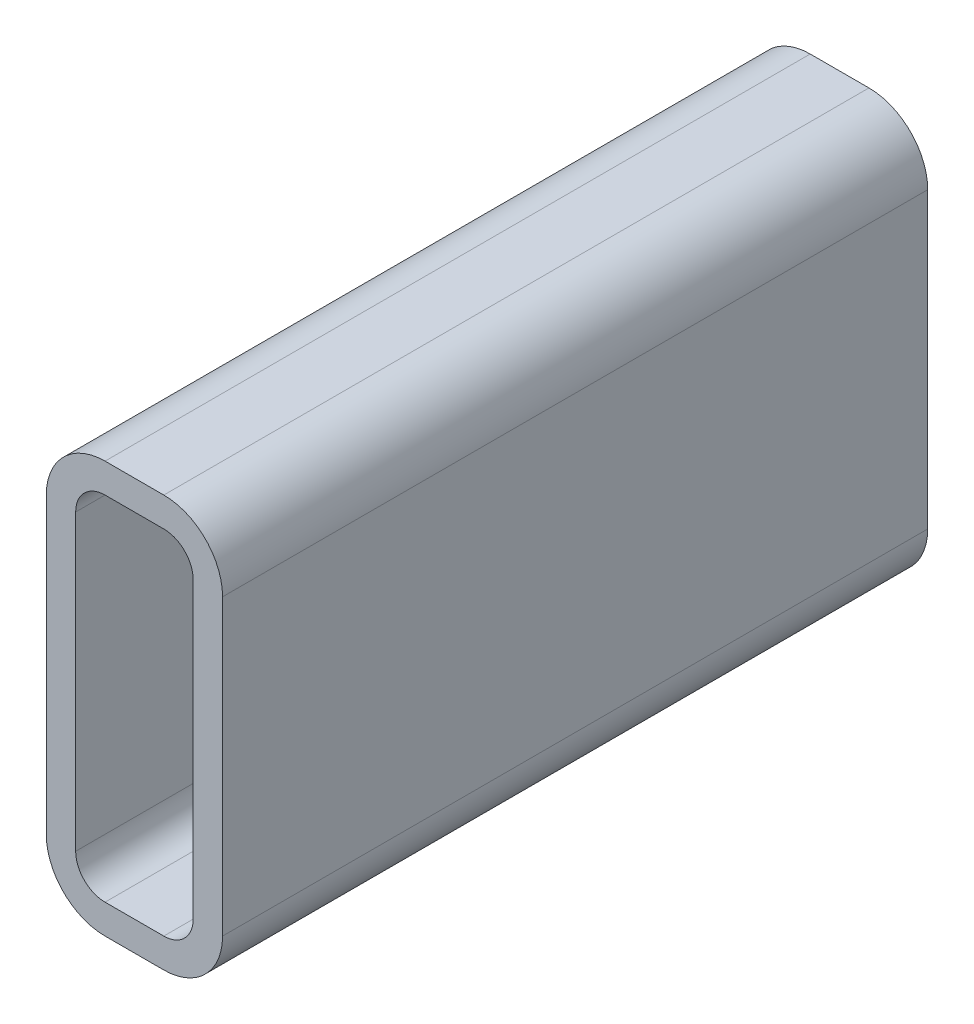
ISO-10303-21;
HEADER;
FILE_DESCRIPTION(('STEP AP214'),'2;1');
FILE_NAME('part.step','',(''),(''),'','','');
FILE_SCHEMA(('AUTOMOTIVE_DESIGN { 1 0 10303 214 1 1 1 1 }'));
ENDSEC;
DATA;
#1=APPLICATION_CONTEXT('core data for automotive mechanical design processes');
#2=APPLICATION_PROTOCOL_DEFINITION('international standard','automotive_design',2000,#1);
#3=PRODUCT_CONTEXT('',#1,'mechanical');
#4=PRODUCT('Part','Part','',(#3));
#5=PRODUCT_RELATED_PRODUCT_CATEGORY('part','',(#4));
#6=PRODUCT_DEFINITION_FORMATION('','',#4);
#7=PRODUCT_DEFINITION_CONTEXT('part definition',#1,'design');
#8=PRODUCT_DEFINITION('design','',#6,#7);
#9=PRODUCT_DEFINITION_SHAPE('','',#8);
#10=(LENGTH_UNIT() NAMED_UNIT(*) SI_UNIT(.MILLI.,.METRE.));
#11=(NAMED_UNIT(*) PLANE_ANGLE_UNIT() SI_UNIT($,.RADIAN.));
#12=(NAMED_UNIT(*) SI_UNIT($,.STERADIAN.) SOLID_ANGLE_UNIT());
#13=UNCERTAINTY_MEASURE_WITH_UNIT(LENGTH_MEASURE(1.E-05),#10,'distance_accuracy_value','');
#14=(GEOMETRIC_REPRESENTATION_CONTEXT(3) GLOBAL_UNCERTAINTY_ASSIGNED_CONTEXT((#13)) GLOBAL_UNIT_ASSIGNED_CONTEXT((#10,
#11,#12)) REPRESENTATION_CONTEXT('',''));
#15=CARTESIAN_POINT('',(0.,0.,0.));
#16=DIRECTION('',(0.,0.,1.));
#17=DIRECTION('',(1.,0.,0.));
#18=AXIS2_PLACEMENT_3D('',#15,#16,#17);
#19=CARTESIAN_POINT('',(27.8891160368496,154.389039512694,304.8));
#20=DIRECTION('',(0.,0.,1.));
#21=DIRECTION('',(1.,0.,0.));
#22=AXIS2_PLACEMENT_3D('',#19,#20,#21);
#23=PLANE('',#22);
#24=CARTESIAN_POINT('',(27.8891160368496,154.389039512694,304.8));
#25=DIRECTION('',(0.,0.,1.));
#26=DIRECTION('',(1.,0.,0.));
#27=AXIS2_PLACEMENT_3D('',#24,#25,#26);
#28=CIRCLE('',#27,25.4);
#29=CARTESIAN_POINT('',(27.8891160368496,179.789039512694,304.8));
#30=VERTEX_POINT('',#29);
#31=CARTESIAN_POINT('',(2.48911603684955,154.389039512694,304.8));
#32=VERTEX_POINT('',#31);
#33=EDGE_CURVE('E211',#30,#32,#28,.T.);
#34=ORIENTED_EDGE('',*,*,#33,.T.);
#35=DIRECTION('',(0.,-1.,0.));
#36=VECTOR('',#35,1.);
#37=CARTESIAN_POINT('',(2.48911603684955,27.3890395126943,304.8));
#38=LINE('',#37,#36);
#39=CARTESIAN_POINT('',(2.48911603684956,27.3890395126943,304.8));
#40=VERTEX_POINT('',#39);
#41=EDGE_CURVE('E214',#32,#40,#38,.T.);
#42=ORIENTED_EDGE('',*,*,#41,.T.);
#43=CARTESIAN_POINT('',(27.8891160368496,27.3890395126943,304.8));
#44=DIRECTION('',(0.,0.,1.));
#45=DIRECTION('',(1.,0.,0.));
#46=AXIS2_PLACEMENT_3D('',#43,#44,#45);
#47=CIRCLE('',#46,25.4);
#48=CARTESIAN_POINT('',(27.8891160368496,1.98903951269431,304.8));
#49=VERTEX_POINT('',#48);
#50=EDGE_CURVE('E217',#40,#49,#47,.T.);
#51=ORIENTED_EDGE('',*,*,#50,.T.);
#52=DIRECTION('',(1.,0.,0.));
#53=VECTOR('',#52,1.);
#54=CARTESIAN_POINT('',(53.2891160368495,1.98903951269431,304.8));
#55=LINE('',#54,#53);
#56=CARTESIAN_POINT('',(53.2891160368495,1.98903951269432,304.8));
#57=VERTEX_POINT('',#56);
#58=EDGE_CURVE('E219',#49,#57,#55,.T.);
#59=ORIENTED_EDGE('',*,*,#58,.T.);
#60=CARTESIAN_POINT('',(53.2891160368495,27.3890395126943,304.8));
#61=DIRECTION('',(0.,0.,1.));
#62=DIRECTION('',(1.,0.,0.));
#63=AXIS2_PLACEMENT_3D('',#60,#61,#62);
#64=CIRCLE('',#63,25.4);
#65=CARTESIAN_POINT('',(78.6891160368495,27.3890395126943,304.8));
#66=VERTEX_POINT('',#65);
#67=EDGE_CURVE('E221',#57,#66,#64,.T.);
#68=ORIENTED_EDGE('',*,*,#67,.T.);
#69=DIRECTION('',(0.,1.,0.));
#70=VECTOR('',#69,1.);
#71=CARTESIAN_POINT('',(78.6891160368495,154.389039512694,304.8));
#72=LINE('',#71,#70);
#73=CARTESIAN_POINT('',(78.6891160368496,154.389039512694,304.8));
#74=VERTEX_POINT('',#73);
#75=EDGE_CURVE('E223',#66,#74,#72,.T.);
#76=ORIENTED_EDGE('',*,*,#75,.T.);
#77=CARTESIAN_POINT('',(53.2891160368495,154.389039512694,304.8));
#78=DIRECTION('',(0.,0.,1.));
#79=DIRECTION('',(1.,0.,0.));
#80=AXIS2_PLACEMENT_3D('',#77,#78,#79);
#81=CIRCLE('',#80,25.4);
#82=CARTESIAN_POINT('',(53.2891160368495,179.789039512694,304.8));
#83=VERTEX_POINT('',#82);
#84=EDGE_CURVE('E225',#74,#83,#81,.T.);
#85=ORIENTED_EDGE('',*,*,#84,.T.);
#86=DIRECTION('',(-1.,0.,0.));
#87=VECTOR('',#86,1.);
#88=CARTESIAN_POINT('',(27.8891160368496,179.789039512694,304.8));
#89=LINE('',#88,#87);
#90=EDGE_CURVE('E227',#83,#30,#89,.T.);
#91=ORIENTED_EDGE('',*,*,#90,.T.);
#92=EDGE_LOOP('',(#34,#42,#51,#59,#68,#76,#85,#91));
#93=FACE_BOUND('',#92,.T.);
#94=DIRECTION('',(0.,-1.,0.));
#95=VECTOR('',#94,1.);
#96=CARTESIAN_POINT('',(15.1891160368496,27.3890395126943,304.8));
#97=LINE('',#96,#95);
#98=CARTESIAN_POINT('',(15.1891160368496,154.389039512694,304.8));
#99=VERTEX_POINT('',#98);
#100=CARTESIAN_POINT('',(15.1891160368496,27.3890395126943,304.8));
#101=VERTEX_POINT('',#100);
#102=EDGE_CURVE('E154',#99,#101,#97,.T.);
#103=ORIENTED_EDGE('',*,*,#102,.F.);
#104=CARTESIAN_POINT('',(27.8891160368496,154.389039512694,304.8));
#105=DIRECTION('',(0.,0.,1.));
#106=DIRECTION('',(1.,0.,0.));
#107=AXIS2_PLACEMENT_3D('',#104,#105,#106);
#108=CIRCLE('',#107,12.7);
#109=CARTESIAN_POINT('',(27.8891160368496,167.089039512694,304.8));
#110=VERTEX_POINT('',#109);
#111=EDGE_CURVE('E146',#110,#99,#108,.T.);
#112=ORIENTED_EDGE('',*,*,#111,.F.);
#113=DIRECTION('',(-1.,0.,0.));
#114=VECTOR('',#113,1.);
#115=CARTESIAN_POINT('',(27.8891160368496,167.089039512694,304.8));
#116=LINE('',#115,#114);
#117=CARTESIAN_POINT('',(53.2891160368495,167.089039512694,304.8));
#118=VERTEX_POINT('',#117);
#119=EDGE_CURVE('E179',#118,#110,#116,.T.);
#120=ORIENTED_EDGE('',*,*,#119,.F.);
#121=CARTESIAN_POINT('',(53.2891160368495,154.389039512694,304.8));
#122=DIRECTION('',(0.,0.,1.));
#123=DIRECTION('',(1.,0.,0.));
#124=AXIS2_PLACEMENT_3D('',#121,#122,#123);
#125=CIRCLE('',#124,12.7);
#126=CARTESIAN_POINT('',(65.9891160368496,154.389039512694,304.8));
#127=VERTEX_POINT('',#126);
#128=EDGE_CURVE('E177',#127,#118,#125,.T.);
#129=ORIENTED_EDGE('',*,*,#128,.F.);
#130=DIRECTION('',(0.,1.,0.));
#131=VECTOR('',#130,1.);
#132=CARTESIAN_POINT('',(65.9891160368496,154.389039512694,304.8));
#133=LINE('',#132,#131);
#134=CARTESIAN_POINT('',(65.9891160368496,27.3890395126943,304.8));
#135=VERTEX_POINT('',#134);
#136=EDGE_CURVE('E175',#135,#127,#133,.T.);
#137=ORIENTED_EDGE('',*,*,#136,.F.);
#138=CARTESIAN_POINT('',(53.2891160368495,27.3890395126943,304.8));
#139=DIRECTION('',(0.,0.,1.));
#140=DIRECTION('',(1.,0.,0.));
#141=AXIS2_PLACEMENT_3D('',#138,#139,#140);
#142=CIRCLE('',#141,12.7);
#143=CARTESIAN_POINT('',(53.2891160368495,14.6890395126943,304.8));
#144=VERTEX_POINT('',#143);
#145=EDGE_CURVE('E173',#144,#135,#142,.T.);
#146=ORIENTED_EDGE('',*,*,#145,.F.);
#147=DIRECTION('',(1.,0.,0.));
#148=VECTOR('',#147,1.);
#149=CARTESIAN_POINT('',(53.2891160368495,14.6890395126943,304.8));
#150=LINE('',#149,#148);
#151=CARTESIAN_POINT('',(27.8891160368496,14.6890395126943,304.8));
#152=VERTEX_POINT('',#151);
#153=EDGE_CURVE('E169',#152,#144,#150,.T.);
#154=ORIENTED_EDGE('',*,*,#153,.F.);
#155=CARTESIAN_POINT('',(27.8891160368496,27.3890395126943,304.8));
#156=DIRECTION('',(0.,0.,1.));
#157=DIRECTION('',(1.,0.,0.));
#158=AXIS2_PLACEMENT_3D('',#155,#156,#157);
#159=CIRCLE('',#158,12.7);
#160=EDGE_CURVE('E167',#101,#152,#159,.T.);
#161=ORIENTED_EDGE('',*,*,#160,.F.);
#162=EDGE_LOOP('',(#103,#112,#120,#129,#137,#146,#154,#161));
#163=FACE_BOUND('',#162,.T.);
#164=ADVANCED_FACE('F33',(#93,#163),#23,.T.);
#165=CARTESIAN_POINT('',(27.8891160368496,154.389039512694,0.));
#166=DIRECTION('',(0.,0.,1.));
#167=DIRECTION('',(1.,0.,0.));
#168=AXIS2_PLACEMENT_3D('',#165,#166,#167);
#169=PLANE('',#168);
#170=CARTESIAN_POINT('',(27.8891160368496,154.389039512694,0.));
#171=DIRECTION('',(0.,0.,1.));
#172=DIRECTION('',(1.,0.,0.));
#173=AXIS2_PLACEMENT_3D('',#170,#171,#172);
#174=CIRCLE('',#173,25.4);
#175=CARTESIAN_POINT('',(27.8891160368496,179.789039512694,0.));
#176=VERTEX_POINT('',#175);
#177=CARTESIAN_POINT('',(2.48911603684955,154.389039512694,0.));
#178=VERTEX_POINT('',#177);
#179=EDGE_CURVE('E162',#176,#178,#174,.T.);
#180=ORIENTED_EDGE('',*,*,#179,.F.);
#181=DIRECTION('',(-1.,0.,0.));
#182=VECTOR('',#181,1.);
#183=CARTESIAN_POINT('',(27.8891160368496,179.789039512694,0.));
#184=LINE('',#183,#182);
#185=CARTESIAN_POINT('',(53.2891160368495,179.789039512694,0.));
#186=VERTEX_POINT('',#185);
#187=EDGE_CURVE('E215',#186,#176,#184,.T.);
#188=ORIENTED_EDGE('',*,*,#187,.F.);
#189=CARTESIAN_POINT('',(53.2891160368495,154.389039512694,0.));
#190=DIRECTION('',(0.,0.,1.));
#191=DIRECTION('',(1.,0.,0.));
#192=AXIS2_PLACEMENT_3D('',#189,#190,#191);
#193=CIRCLE('',#192,25.4);
#194=CARTESIAN_POINT('',(78.6891160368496,154.389039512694,0.));
#195=VERTEX_POINT('',#194);
#196=EDGE_CURVE('E242',#195,#186,#193,.T.);
#197=ORIENTED_EDGE('',*,*,#196,.F.);
#198=DIRECTION('',(0.,1.,0.));
#199=VECTOR('',#198,1.);
#200=CARTESIAN_POINT('',(78.6891160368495,154.389039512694,0.));
#201=LINE('',#200,#199);
#202=CARTESIAN_POINT('',(78.6891160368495,27.3890395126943,0.));
#203=VERTEX_POINT('',#202);
#204=EDGE_CURVE('E240',#203,#195,#201,.T.);
#205=ORIENTED_EDGE('',*,*,#204,.F.);
#206=CARTESIAN_POINT('',(53.2891160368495,27.3890395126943,0.));
#207=DIRECTION('',(0.,0.,1.));
#208=DIRECTION('',(1.,0.,0.));
#209=AXIS2_PLACEMENT_3D('',#206,#207,#208);
#210=CIRCLE('',#209,25.4);
#211=CARTESIAN_POINT('',(53.2891160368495,1.98903951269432,0.));
#212=VERTEX_POINT('',#211);
#213=EDGE_CURVE('E238',#212,#203,#210,.T.);
#214=ORIENTED_EDGE('',*,*,#213,.F.);
#215=DIRECTION('',(1.,0.,0.));
#216=VECTOR('',#215,1.);
#217=CARTESIAN_POINT('',(53.2891160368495,1.98903951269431,0.));
#218=LINE('',#217,#216);
#219=CARTESIAN_POINT('',(27.8891160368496,1.98903951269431,0.));
#220=VERTEX_POINT('',#219);
#221=EDGE_CURVE('E236',#220,#212,#218,.T.);
#222=ORIENTED_EDGE('',*,*,#221,.F.);
#223=CARTESIAN_POINT('',(27.8891160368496,27.3890395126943,0.));
#224=DIRECTION('',(0.,0.,1.));
#225=DIRECTION('',(1.,0.,0.));
#226=AXIS2_PLACEMENT_3D('',#223,#224,#225);
#227=CIRCLE('',#226,25.4);
#228=CARTESIAN_POINT('',(2.48911603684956,27.3890395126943,0.));
#229=VERTEX_POINT('',#228);
#230=EDGE_CURVE('E234',#229,#220,#227,.T.);
#231=ORIENTED_EDGE('',*,*,#230,.F.);
#232=DIRECTION('',(0.,-1.,0.));
#233=VECTOR('',#232,1.);
#234=CARTESIAN_POINT('',(2.48911603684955,27.3890395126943,0.));
#235=LINE('',#234,#233);
#236=EDGE_CURVE('E232',#178,#229,#235,.T.);
#237=ORIENTED_EDGE('',*,*,#236,.F.);
#238=EDGE_LOOP('',(#180,#188,#197,#205,#214,#222,#231,#237));
#239=FACE_BOUND('',#238,.T.);
#240=CARTESIAN_POINT('',(27.8891160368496,154.389039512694,0.));
#241=DIRECTION('',(0.,0.,1.));
#242=DIRECTION('',(1.,0.,0.));
#243=AXIS2_PLACEMENT_3D('',#240,#241,#242);
#244=CIRCLE('',#243,12.7);
#245=CARTESIAN_POINT('',(27.8891160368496,167.089039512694,0.));
#246=VERTEX_POINT('',#245);
#247=CARTESIAN_POINT('',(15.1891160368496,154.389039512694,0.));
#248=VERTEX_POINT('',#247);
#249=EDGE_CURVE('E56',#246,#248,#244,.T.);
#250=ORIENTED_EDGE('',*,*,#249,.T.);
#251=DIRECTION('',(0.,-1.,0.));
#252=VECTOR('',#251,1.);
#253=CARTESIAN_POINT('',(15.1891160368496,27.3890395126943,0.));
#254=LINE('',#253,#252);
#255=CARTESIAN_POINT('',(15.1891160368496,27.3890395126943,0.));
#256=VERTEX_POINT('',#255);
#257=EDGE_CURVE('E161',#248,#256,#254,.T.);
#258=ORIENTED_EDGE('',*,*,#257,.T.);
#259=CARTESIAN_POINT('',(27.8891160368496,27.3890395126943,0.));
#260=DIRECTION('',(0.,0.,1.));
#261=DIRECTION('',(1.,0.,0.));
#262=AXIS2_PLACEMENT_3D('',#259,#260,#261);
#263=CIRCLE('',#262,12.7);
#264=CARTESIAN_POINT('',(27.8891160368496,14.6890395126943,0.));
#265=VERTEX_POINT('',#264);
#266=EDGE_CURVE('E183',#256,#265,#263,.T.);
#267=ORIENTED_EDGE('',*,*,#266,.T.);
#268=DIRECTION('',(1.,0.,0.));
#269=VECTOR('',#268,1.);
#270=CARTESIAN_POINT('',(53.2891160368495,14.6890395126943,0.));
#271=LINE('',#270,#269);
#272=CARTESIAN_POINT('',(53.2891160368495,14.6890395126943,0.));
#273=VERTEX_POINT('',#272);
#274=EDGE_CURVE('E186',#265,#273,#271,.T.);
#275=ORIENTED_EDGE('',*,*,#274,.T.);
#276=CARTESIAN_POINT('',(53.2891160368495,27.3890395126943,0.));
#277=DIRECTION('',(0.,0.,1.));
#278=DIRECTION('',(1.,0.,0.));
#279=AXIS2_PLACEMENT_3D('',#276,#277,#278);
#280=CIRCLE('',#279,12.7);
#281=CARTESIAN_POINT('',(65.9891160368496,27.3890395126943,0.));
#282=VERTEX_POINT('',#281);
#283=EDGE_CURVE('E189',#273,#282,#280,.T.);
#284=ORIENTED_EDGE('',*,*,#283,.T.);
#285=DIRECTION('',(0.,1.,0.));
#286=VECTOR('',#285,1.);
#287=CARTESIAN_POINT('',(65.9891160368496,154.389039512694,0.));
#288=LINE('',#287,#286);
#289=CARTESIAN_POINT('',(65.9891160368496,154.389039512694,0.));
#290=VERTEX_POINT('',#289);
#291=EDGE_CURVE('E192',#282,#290,#288,.T.);
#292=ORIENTED_EDGE('',*,*,#291,.T.);
#293=CARTESIAN_POINT('',(53.2891160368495,154.389039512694,0.));
#294=DIRECTION('',(0.,0.,1.));
#295=DIRECTION('',(1.,0.,0.));
#296=AXIS2_PLACEMENT_3D('',#293,#294,#295);
#297=CIRCLE('',#296,12.7);
#298=CARTESIAN_POINT('',(53.2891160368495,167.089039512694,0.));
#299=VERTEX_POINT('',#298);
#300=EDGE_CURVE('E195',#290,#299,#297,.T.);
#301=ORIENTED_EDGE('',*,*,#300,.T.);
#302=DIRECTION('',(-1.,0.,0.));
#303=VECTOR('',#302,1.);
#304=CARTESIAN_POINT('',(27.8891160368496,167.089039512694,0.));
#305=LINE('',#304,#303);
#306=EDGE_CURVE('E155',#299,#246,#305,.T.);
#307=ORIENTED_EDGE('',*,*,#306,.T.);
#308=EDGE_LOOP('',(#250,#258,#267,#275,#284,#292,#301,#307));
#309=FACE_BOUND('',#308,.T.);
#310=ADVANCED_FACE('F272',(#239,#309),#169,.F.);
#311=CARTESIAN_POINT('',(27.8891160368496,154.389039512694,304.8));
#312=DIRECTION('',(0.,0.,-1.));
#313=DIRECTION('',(-1.,0.,0.));
#314=AXIS2_PLACEMENT_3D('',#311,#312,#313);
#315=CYLINDRICAL_SURFACE('',#314,25.4);
#316=ORIENTED_EDGE('',*,*,#179,.T.);
#317=DIRECTION('',(0.,0.,-1.));
#318=VECTOR('',#317,1.);
#319=CARTESIAN_POINT('',(2.48911603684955,154.389039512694,304.8));
#320=LINE('',#319,#318);
#321=EDGE_CURVE('E11',#32,#178,#320,.T.);
#322=ORIENTED_EDGE('',*,*,#321,.F.);
#323=ORIENTED_EDGE('',*,*,#33,.F.);
#324=DIRECTION('',(0.,0.,-1.));
#325=VECTOR('',#324,1.);
#326=CARTESIAN_POINT('',(27.8891160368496,179.789039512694,304.8));
#327=LINE('',#326,#325);
#328=EDGE_CURVE('E229',#30,#176,#327,.T.);
#329=ORIENTED_EDGE('',*,*,#328,.T.);
#330=EDGE_LOOP('',(#316,#322,#323,#329));
#331=FACE_BOUND('',#330,.T.);
#332=ADVANCED_FACE('F35',(#331),#315,.T.);
#333=CARTESIAN_POINT('',(2.48911603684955,27.3890395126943,304.8));
#334=DIRECTION('',(1.,0.,0.));
#335=DIRECTION('',(0.,0.,-1.));
#336=AXIS2_PLACEMENT_3D('',#333,#334,#335);
#337=PLANE('',#336);
#338=ORIENTED_EDGE('',*,*,#236,.T.);
#339=DIRECTION('',(0.,0.,-1.));
#340=VECTOR('',#339,1.);
#341=CARTESIAN_POINT('',(2.48911603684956,27.3890395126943,304.8));
#342=LINE('',#341,#340);
#343=EDGE_CURVE('E41',#40,#229,#342,.T.);
#344=ORIENTED_EDGE('',*,*,#343,.F.);
#345=ORIENTED_EDGE('',*,*,#41,.F.);
#346=ORIENTED_EDGE('',*,*,#321,.T.);
#347=EDGE_LOOP('',(#338,#344,#345,#346));
#348=FACE_BOUND('',#347,.T.);
#349=ADVANCED_FACE('F289',(#348),#337,.F.);
#350=CARTESIAN_POINT('',(27.8891160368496,27.3890395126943,304.8));
#351=DIRECTION('',(0.,0.,-1.));
#352=DIRECTION('',(-1.,0.,0.));
#353=AXIS2_PLACEMENT_3D('',#350,#351,#352);
#354=CYLINDRICAL_SURFACE('',#353,25.4);
#355=ORIENTED_EDGE('',*,*,#230,.T.);
#356=DIRECTION('',(0.,0.,-1.));
#357=VECTOR('',#356,1.);
#358=CARTESIAN_POINT('',(27.8891160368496,1.98903951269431,304.8));
#359=LINE('',#358,#357);
#360=EDGE_CURVE('E259',#49,#220,#359,.T.);
#361=ORIENTED_EDGE('',*,*,#360,.F.);
#362=ORIENTED_EDGE('',*,*,#50,.F.);
#363=ORIENTED_EDGE('',*,*,#343,.T.);
#364=EDGE_LOOP('',(#355,#361,#362,#363));
#365=FACE_BOUND('',#364,.T.);
#366=ADVANCED_FACE('F266',(#365),#354,.T.);
#367=CARTESIAN_POINT('',(53.2891160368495,1.98903951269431,304.8));
#368=DIRECTION('',(0.,1.,0.));
#369=DIRECTION('',(0.,0.,1.));
#370=AXIS2_PLACEMENT_3D('',#367,#368,#369);
#371=PLANE('',#370);
#372=ORIENTED_EDGE('',*,*,#221,.T.);
#373=DIRECTION('',(0.,0.,-1.));
#374=VECTOR('',#373,1.);
#375=CARTESIAN_POINT('',(53.2891160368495,1.98903951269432,304.8));
#376=LINE('',#375,#374);
#377=EDGE_CURVE('E256',#57,#212,#376,.T.);
#378=ORIENTED_EDGE('',*,*,#377,.F.);
#379=ORIENTED_EDGE('',*,*,#58,.F.);
#380=ORIENTED_EDGE('',*,*,#360,.T.);
#381=EDGE_LOOP('',(#372,#378,#379,#380));
#382=FACE_BOUND('',#381,.T.);
#383=ADVANCED_FACE('F278',(#382),#371,.F.);
#384=CARTESIAN_POINT('',(53.2891160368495,27.3890395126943,304.8));
#385=DIRECTION('',(0.,0.,-1.));
#386=DIRECTION('',(-1.,0.,0.));
#387=AXIS2_PLACEMENT_3D('',#384,#385,#386);
#388=CYLINDRICAL_SURFACE('',#387,25.4);
#389=ORIENTED_EDGE('',*,*,#213,.T.);
#390=DIRECTION('',(0.,0.,-1.));
#391=VECTOR('',#390,1.);
#392=CARTESIAN_POINT('',(78.6891160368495,27.3890395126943,304.8));
#393=LINE('',#392,#391);
#394=EDGE_CURVE('E253',#66,#203,#393,.T.);
#395=ORIENTED_EDGE('',*,*,#394,.F.);
#396=ORIENTED_EDGE('',*,*,#67,.F.);
#397=ORIENTED_EDGE('',*,*,#377,.T.);
#398=EDGE_LOOP('',(#389,#395,#396,#397));
#399=FACE_BOUND('',#398,.T.);
#400=ADVANCED_FACE('F282',(#399),#388,.T.);
#401=CARTESIAN_POINT('',(78.6891160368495,154.389039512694,304.8));
#402=DIRECTION('',(-1.,0.,0.));
#403=DIRECTION('',(0.,0.,1.));
#404=AXIS2_PLACEMENT_3D('',#401,#402,#403);
#405=PLANE('',#404);
#406=ORIENTED_EDGE('',*,*,#204,.T.);
#407=DIRECTION('',(0.,0.,-1.));
#408=VECTOR('',#407,1.);
#409=CARTESIAN_POINT('',(78.6891160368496,154.389039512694,304.8));
#410=LINE('',#409,#408);
#411=EDGE_CURVE('E250',#74,#195,#410,.T.);
#412=ORIENTED_EDGE('',*,*,#411,.F.);
#413=ORIENTED_EDGE('',*,*,#75,.F.);
#414=ORIENTED_EDGE('',*,*,#394,.T.);
#415=EDGE_LOOP('',(#406,#412,#413,#414));
#416=FACE_BOUND('',#415,.T.);
#417=ADVANCED_FACE('F302',(#416),#405,.F.);
#418=CARTESIAN_POINT('',(53.2891160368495,154.389039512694,304.8));
#419=DIRECTION('',(0.,0.,-1.));
#420=DIRECTION('',(-1.,0.,0.));
#421=AXIS2_PLACEMENT_3D('',#418,#419,#420);
#422=CYLINDRICAL_SURFACE('',#421,25.4);
#423=ORIENTED_EDGE('',*,*,#196,.T.);
#424=DIRECTION('',(0.,0.,-1.));
#425=VECTOR('',#424,1.);
#426=CARTESIAN_POINT('',(53.2891160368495,179.789039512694,304.8));
#427=LINE('',#426,#425);
#428=EDGE_CURVE('E247',#83,#186,#427,.T.);
#429=ORIENTED_EDGE('',*,*,#428,.F.);
#430=ORIENTED_EDGE('',*,*,#84,.F.);
#431=ORIENTED_EDGE('',*,*,#411,.T.);
#432=EDGE_LOOP('',(#423,#429,#430,#431));
#433=FACE_BOUND('',#432,.T.);
#434=ADVANCED_FACE('F300',(#433),#422,.T.);
#435=CARTESIAN_POINT('',(27.8891160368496,179.789039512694,304.8));
#436=DIRECTION('',(0.,-1.,0.));
#437=DIRECTION('',(0.,0.,-1.));
#438=AXIS2_PLACEMENT_3D('',#435,#436,#437);
#439=PLANE('',#438);
#440=ORIENTED_EDGE('',*,*,#187,.T.);
#441=ORIENTED_EDGE('',*,*,#328,.F.);
#442=ORIENTED_EDGE('',*,*,#90,.F.);
#443=ORIENTED_EDGE('',*,*,#428,.T.);
#444=EDGE_LOOP('',(#440,#441,#442,#443));
#445=FACE_BOUND('',#444,.T.);
#446=ADVANCED_FACE('F295',(#445),#439,.F.);
#447=CARTESIAN_POINT('',(27.8891160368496,154.389039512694,304.8));
#448=DIRECTION('',(0.,0.,-1.));
#449=DIRECTION('',(-1.,0.,0.));
#450=AXIS2_PLACEMENT_3D('',#447,#448,#449);
#451=CYLINDRICAL_SURFACE('',#450,12.7);
#452=ORIENTED_EDGE('',*,*,#249,.F.);
#453=DIRECTION('',(0.,0.,-1.));
#454=VECTOR('',#453,1.);
#455=CARTESIAN_POINT('',(27.8891160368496,167.089039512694,304.8));
#456=LINE('',#455,#454);
#457=EDGE_CURVE('E150',#110,#246,#456,.T.);
#458=ORIENTED_EDGE('',*,*,#457,.F.);
#459=ORIENTED_EDGE('',*,*,#111,.T.);
#460=DIRECTION('',(0.,0.,-1.));
#461=VECTOR('',#460,1.);
#462=CARTESIAN_POINT('',(15.1891160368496,154.389039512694,304.8));
#463=LINE('',#462,#461);
#464=EDGE_CURVE('E149',#99,#248,#463,.T.);
#465=ORIENTED_EDGE('',*,*,#464,.T.);
#466=EDGE_LOOP('',(#452,#458,#459,#465));
#467=FACE_BOUND('',#466,.T.);
#468=ADVANCED_FACE('F148',(#467),#451,.F.);
#469=CARTESIAN_POINT('',(15.1891160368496,27.3890395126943,304.8));
#470=DIRECTION('',(1.,0.,0.));
#471=DIRECTION('',(0.,0.,-1.));
#472=AXIS2_PLACEMENT_3D('',#469,#470,#471);
#473=PLANE('',#472);
#474=ORIENTED_EDGE('',*,*,#257,.F.);
#475=ORIENTED_EDGE('',*,*,#464,.F.);
#476=ORIENTED_EDGE('',*,*,#102,.T.);
#477=DIRECTION('',(0.,0.,-1.));
#478=VECTOR('',#477,1.);
#479=CARTESIAN_POINT('',(15.1891160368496,27.3890395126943,304.8));
#480=LINE('',#479,#478);
#481=EDGE_CURVE('E163',#101,#256,#480,.T.);
#482=ORIENTED_EDGE('',*,*,#481,.T.);
#483=EDGE_LOOP('',(#474,#475,#476,#482));
#484=FACE_BOUND('',#483,.T.);
#485=ADVANCED_FACE('F158',(#484),#473,.T.);
#486=CARTESIAN_POINT('',(27.8891160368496,27.3890395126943,304.8));
#487=DIRECTION('',(0.,0.,-1.));
#488=DIRECTION('',(-1.,0.,0.));
#489=AXIS2_PLACEMENT_3D('',#486,#487,#488);
#490=CYLINDRICAL_SURFACE('',#489,12.7);
#491=ORIENTED_EDGE('',*,*,#266,.F.);
#492=ORIENTED_EDGE('',*,*,#481,.F.);
#493=ORIENTED_EDGE('',*,*,#160,.T.);
#494=DIRECTION('',(0.,0.,-1.));
#495=VECTOR('',#494,1.);
#496=CARTESIAN_POINT('',(27.8891160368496,14.6890395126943,304.8));
#497=LINE('',#496,#495);
#498=EDGE_CURVE('E208',#152,#265,#497,.T.);
#499=ORIENTED_EDGE('',*,*,#498,.T.);
#500=EDGE_LOOP('',(#491,#492,#493,#499));
#501=FACE_BOUND('',#500,.T.);
#502=ADVANCED_FACE('F327',(#501),#490,.F.);
#503=CARTESIAN_POINT('',(53.2891160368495,14.6890395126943,304.8));
#504=DIRECTION('',(0.,1.,0.));
#505=DIRECTION('',(0.,0.,1.));
#506=AXIS2_PLACEMENT_3D('',#503,#504,#505);
#507=PLANE('',#506);
#508=ORIENTED_EDGE('',*,*,#274,.F.);
#509=ORIENTED_EDGE('',*,*,#498,.F.);
#510=ORIENTED_EDGE('',*,*,#153,.T.);
#511=DIRECTION('',(0.,0.,-1.));
#512=VECTOR('',#511,1.);
#513=CARTESIAN_POINT('',(53.2891160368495,14.6890395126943,304.8));
#514=LINE('',#513,#512);
#515=EDGE_CURVE('E206',#144,#273,#514,.T.);
#516=ORIENTED_EDGE('',*,*,#515,.T.);
#517=EDGE_LOOP('',(#508,#509,#510,#516));
#518=FACE_BOUND('',#517,.T.);
#519=ADVANCED_FACE('F331',(#518),#507,.T.);
#520=CARTESIAN_POINT('',(53.2891160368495,27.3890395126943,304.8));
#521=DIRECTION('',(0.,0.,-1.));
#522=DIRECTION('',(-1.,0.,0.));
#523=AXIS2_PLACEMENT_3D('',#520,#521,#522);
#524=CYLINDRICAL_SURFACE('',#523,12.7);
#525=ORIENTED_EDGE('',*,*,#283,.F.);
#526=ORIENTED_EDGE('',*,*,#515,.F.);
#527=ORIENTED_EDGE('',*,*,#145,.T.);
#528=DIRECTION('',(0.,0.,-1.));
#529=VECTOR('',#528,1.);
#530=CARTESIAN_POINT('',(65.9891160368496,27.3890395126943,304.8));
#531=LINE('',#530,#529);
#532=EDGE_CURVE('E204',#135,#282,#531,.T.);
#533=ORIENTED_EDGE('',*,*,#532,.T.);
#534=EDGE_LOOP('',(#525,#526,#527,#533));
#535=FACE_BOUND('',#534,.T.);
#536=ADVANCED_FACE('F337',(#535),#524,.F.);
#537=CARTESIAN_POINT('',(65.9891160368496,154.389039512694,304.8));
#538=DIRECTION('',(-1.,0.,0.));
#539=DIRECTION('',(0.,0.,1.));
#540=AXIS2_PLACEMENT_3D('',#537,#538,#539);
#541=PLANE('',#540);
#542=ORIENTED_EDGE('',*,*,#291,.F.);
#543=ORIENTED_EDGE('',*,*,#532,.F.);
#544=ORIENTED_EDGE('',*,*,#136,.T.);
#545=DIRECTION('',(0.,0.,-1.));
#546=VECTOR('',#545,1.);
#547=CARTESIAN_POINT('',(65.9891160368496,154.389039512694,304.8));
#548=LINE('',#547,#546);
#549=EDGE_CURVE('E202',#127,#290,#548,.T.);
#550=ORIENTED_EDGE('',*,*,#549,.T.);
#551=EDGE_LOOP('',(#542,#543,#544,#550));
#552=FACE_BOUND('',#551,.T.);
#553=ADVANCED_FACE('F341',(#552),#541,.T.);
#554=CARTESIAN_POINT('',(53.2891160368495,154.389039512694,304.8));
#555=DIRECTION('',(0.,0.,-1.));
#556=DIRECTION('',(-1.,0.,0.));
#557=AXIS2_PLACEMENT_3D('',#554,#555,#556);
#558=CYLINDRICAL_SURFACE('',#557,12.7);
#559=ORIENTED_EDGE('',*,*,#300,.F.);
#560=ORIENTED_EDGE('',*,*,#549,.F.);
#561=ORIENTED_EDGE('',*,*,#128,.T.);
#562=DIRECTION('',(0.,0.,-1.));
#563=VECTOR('',#562,1.);
#564=CARTESIAN_POINT('',(53.2891160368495,167.089039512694,304.8));
#565=LINE('',#564,#563);
#566=EDGE_CURVE('E48',#118,#299,#565,.T.);
#567=ORIENTED_EDGE('',*,*,#566,.T.);
#568=EDGE_LOOP('',(#559,#560,#561,#567));
#569=FACE_BOUND('',#568,.T.);
#570=ADVANCED_FACE('F345',(#569),#558,.F.);
#571=CARTESIAN_POINT('',(27.8891160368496,167.089039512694,304.8));
#572=DIRECTION('',(0.,-1.,0.));
#573=DIRECTION('',(0.,0.,-1.));
#574=AXIS2_PLACEMENT_3D('',#571,#572,#573);
#575=PLANE('',#574);
#576=ORIENTED_EDGE('',*,*,#306,.F.);
#577=ORIENTED_EDGE('',*,*,#566,.F.);
#578=ORIENTED_EDGE('',*,*,#119,.T.);
#579=ORIENTED_EDGE('',*,*,#457,.T.);
#580=EDGE_LOOP('',(#576,#577,#578,#579));
#581=FACE_BOUND('',#580,.T.);
#582=ADVANCED_FACE('F349',(#581),#575,.T.);
#583=CLOSED_SHELL('',(#164,#310,#332,#349,#366,#383,#400,#417,#434,#446,#468,#485,#502,#519,
#536,#553,#570,#582));
#584=MANIFOLD_SOLID_BREP('B2',#583);
#585=ADVANCED_BREP_SHAPE_REPRESENTATION('',(#18,#584),#14);
#586=SHAPE_DEFINITION_REPRESENTATION(#9,#585);
ENDSEC;
END-ISO-10303-21;
